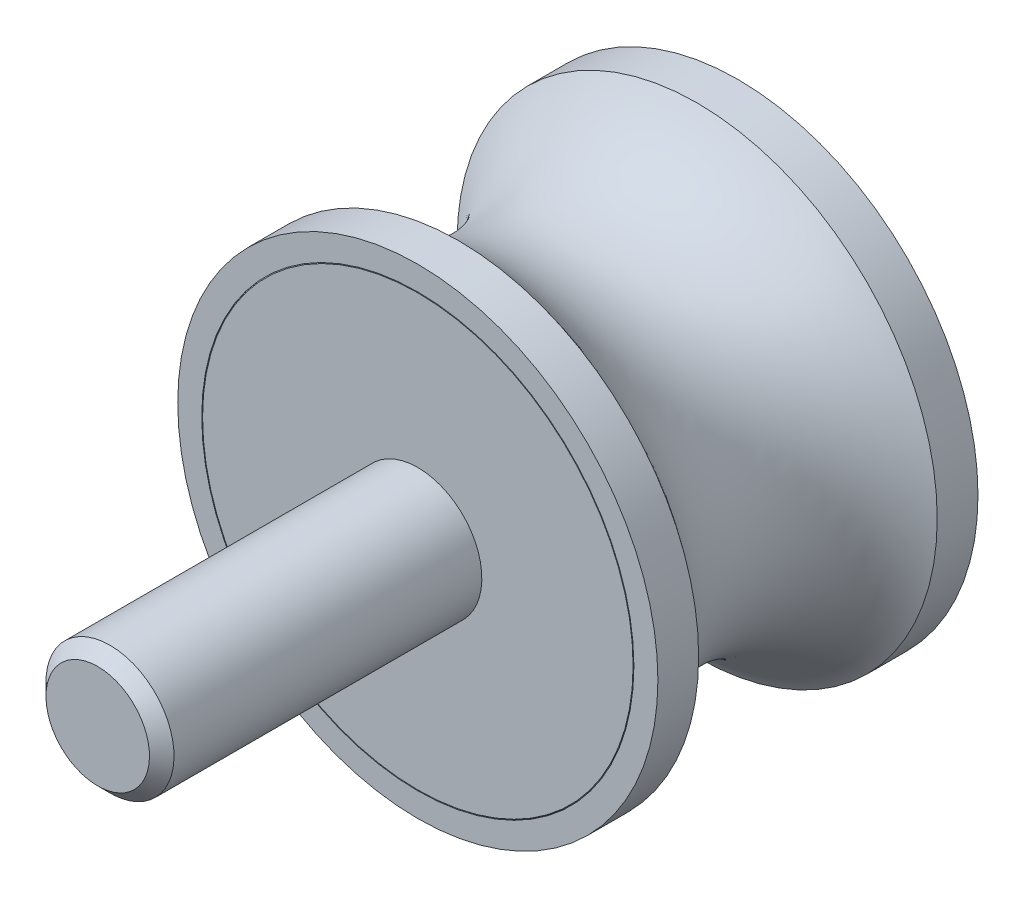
ISO-10303-21;
HEADER;
FILE_DESCRIPTION(('STEP AP214'),'2;1');
FILE_NAME('part.step','',(''),(''),'','','');
FILE_SCHEMA(('AUTOMOTIVE_DESIGN { 1 0 10303 214 1 1 1 1 }'));
ENDSEC;
DATA;
#1=APPLICATION_CONTEXT('core data for automotive mechanical design processes');
#2=APPLICATION_PROTOCOL_DEFINITION('international standard','automotive_design',2000,#1);
#3=PRODUCT_CONTEXT('',#1,'mechanical');
#4=PRODUCT('Part','Part','',(#3));
#5=PRODUCT_RELATED_PRODUCT_CATEGORY('part','',(#4));
#6=PRODUCT_DEFINITION_FORMATION('','',#4);
#7=PRODUCT_DEFINITION_CONTEXT('part definition',#1,'design');
#8=PRODUCT_DEFINITION('design','',#6,#7);
#9=PRODUCT_DEFINITION_SHAPE('','',#8);
#10=(LENGTH_UNIT() NAMED_UNIT(*) SI_UNIT(.MILLI.,.METRE.));
#11=(NAMED_UNIT(*) PLANE_ANGLE_UNIT() SI_UNIT($,.RADIAN.));
#12=(NAMED_UNIT(*) SI_UNIT($,.STERADIAN.) SOLID_ANGLE_UNIT());
#13=UNCERTAINTY_MEASURE_WITH_UNIT(LENGTH_MEASURE(1.E-05),#10,'distance_accuracy_value','');
#14=(GEOMETRIC_REPRESENTATION_CONTEXT(3) GLOBAL_UNCERTAINTY_ASSIGNED_CONTEXT((#13)) GLOBAL_UNIT_ASSIGNED_CONTEXT((#10,
#11,#12)) REPRESENTATION_CONTEXT('',''));
#15=CARTESIAN_POINT('',(0.,0.,0.));
#16=DIRECTION('',(0.,0.,1.));
#17=DIRECTION('',(1.,0.,0.));
#18=AXIS2_PLACEMENT_3D('',#15,#16,#17);
#19=CARTESIAN_POINT('',(0.,0.,0.5));
#20=DIRECTION('',(0.,0.,-1.));
#21=DIRECTION('',(0.,1.,0.));
#22=AXIS2_PLACEMENT_3D('',#19,#20,#21);
#23=CYLINDRICAL_SURFACE('',#22,13.5);
#24=CARTESIAN_POINT('',(0.,0.,0.05));
#25=DIRECTION('',(0.,0.,-1.));
#26=DIRECTION('',(0.,1.,0.));
#27=AXIS2_PLACEMENT_3D('',#24,#25,#26);
#28=CIRCLE('',#27,13.5);
#29=CARTESIAN_POINT('',(0.,13.5,0.05));
#30=VERTEX_POINT('',#29);
#31=EDGE_CURVE('E53',#30,#30,#28,.T.);
#32=ORIENTED_EDGE('',*,*,#31,.F.);
#33=EDGE_LOOP('',(#32));
#34=FACE_BOUND('',#33,.T.);
#35=CARTESIAN_POINT('',(0.,0.,0.));
#36=DIRECTION('',(0.,0.,-1.));
#37=DIRECTION('',(0.,1.,0.));
#38=AXIS2_PLACEMENT_3D('',#35,#36,#37);
#39=CIRCLE('',#38,13.5);
#40=CARTESIAN_POINT('',(0.,13.5,0.));
#41=VERTEX_POINT('',#40);
#42=EDGE_CURVE('E44',#41,#41,#39,.T.);
#43=ORIENTED_EDGE('',*,*,#42,.T.);
#44=EDGE_LOOP('',(#43));
#45=FACE_BOUND('',#44,.T.);
#46=ADVANCED_FACE('F12',(#34,#45),#23,.F.);
#47=CARTESIAN_POINT('',(0.,0.,0.5));
#48=DIRECTION('',(0.,0.,-1.));
#49=DIRECTION('',(0.,1.,0.));
#50=AXIS2_PLACEMENT_3D('',#47,#48,#49);
#51=CYLINDRICAL_SURFACE('',#50,13.5);
#52=CARTESIAN_POINT('',(0.,0.,20.));
#53=DIRECTION('',(0.,0.,-1.));
#54=DIRECTION('',(0.,1.,0.));
#55=AXIS2_PLACEMENT_3D('',#52,#53,#54);
#56=CIRCLE('',#55,13.5);
#57=CARTESIAN_POINT('',(0.,13.5,20.));
#58=VERTEX_POINT('',#57);
#59=EDGE_CURVE('E27',#58,#58,#56,.T.);
#60=ORIENTED_EDGE('',*,*,#59,.F.);
#61=EDGE_LOOP('',(#60));
#62=FACE_BOUND('',#61,.T.);
#63=CARTESIAN_POINT('',(0.,0.,19.95));
#64=DIRECTION('',(0.,0.,-1.));
#65=DIRECTION('',(0.,1.,0.));
#66=AXIS2_PLACEMENT_3D('',#63,#64,#65);
#67=CIRCLE('',#66,13.5);
#68=CARTESIAN_POINT('',(0.,13.5,19.95));
#69=VERTEX_POINT('',#68);
#70=EDGE_CURVE('E50',#69,#69,#67,.T.);
#71=ORIENTED_EDGE('',*,*,#70,.T.);
#72=EDGE_LOOP('',(#71));
#73=FACE_BOUND('',#72,.T.);
#74=ADVANCED_FACE('F89',(#62,#73),#51,.F.);
#75=CARTESIAN_POINT('',(13.5,0.,20.));
#76=DIRECTION('',(0.,0.,-1.));
#77=DIRECTION('',(0.,1.,0.));
#78=AXIS2_PLACEMENT_3D('',#75,#76,#77);
#79=PLANE('',#78);
#80=CARTESIAN_POINT('',(0.,0.,20.));
#81=DIRECTION('',(0.,0.,-1.));
#82=DIRECTION('',(0.,1.,0.));
#83=AXIS2_PLACEMENT_3D('',#80,#81,#82);
#84=CIRCLE('',#83,15.);
#85=CARTESIAN_POINT('',(0.,15.,20.));
#86=VERTEX_POINT('',#85);
#87=EDGE_CURVE('E32',#86,#86,#84,.T.);
#88=ORIENTED_EDGE('',*,*,#87,.F.);
#89=EDGE_LOOP('',(#88));
#90=FACE_BOUND('',#89,.T.);
#91=ORIENTED_EDGE('',*,*,#59,.T.);
#92=EDGE_LOOP('',(#91));
#93=FACE_BOUND('',#92,.T.);
#94=ADVANCED_FACE('F115',(#90,#93),#79,.F.);
#95=CARTESIAN_POINT('',(0.,0.,0.5));
#96=DIRECTION('',(0.,0.,-1.));
#97=DIRECTION('',(0.,1.,0.));
#98=AXIS2_PLACEMENT_3D('',#95,#96,#97);
#99=CYLINDRICAL_SURFACE('',#98,15.);
#100=CARTESIAN_POINT('',(0.,0.,17.4535599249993));
#101=DIRECTION('',(0.,0.,-1.));
#102=DIRECTION('',(0.,1.,0.));
#103=AXIS2_PLACEMENT_3D('',#100,#101,#102);
#104=CIRCLE('',#103,15.);
#105=CARTESIAN_POINT('',(0.,15.,17.4535599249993));
#106=VERTEX_POINT('',#105);
#107=EDGE_CURVE('E35',#106,#106,#104,.T.);
#108=ORIENTED_EDGE('',*,*,#107,.F.);
#109=EDGE_LOOP('',(#108));
#110=FACE_BOUND('',#109,.T.);
#111=ORIENTED_EDGE('',*,*,#87,.T.);
#112=EDGE_LOOP('',(#111));
#113=FACE_BOUND('',#112,.T.);
#114=ADVANCED_FACE('F109',(#110,#113),#99,.T.);
#115=CARTESIAN_POINT('',(0.,0.,10.));
#116=DIRECTION('',(0.,0.,-1.));
#117=DIRECTION('',(0.,1.,0.));
#118=AXIS2_PLACEMENT_3D('',#115,#116,#117);
#119=TOROIDAL_SURFACE('',#118,19.9444444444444,8.94444444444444);
#120=CARTESIAN_POINT('',(0.,0.,2.54644007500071));
#121=DIRECTION('',(0.,0.,-1.));
#122=DIRECTION('',(0.,1.,0.));
#123=AXIS2_PLACEMENT_3D('',#120,#121,#122);
#124=CIRCLE('',#123,15.);
#125=CARTESIAN_POINT('',(0.,15.,2.54644007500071));
#126=VERTEX_POINT('',#125);
#127=EDGE_CURVE('E38',#126,#126,#124,.T.);
#128=ORIENTED_EDGE('',*,*,#127,.F.);
#129=EDGE_LOOP('',(#128));
#130=FACE_BOUND('',#129,.T.);
#131=ORIENTED_EDGE('',*,*,#107,.T.);
#132=EDGE_LOOP('',(#131));
#133=FACE_BOUND('',#132,.T.);
#134=ADVANCED_FACE('F103',(#130,#133),#119,.F.);
#135=CARTESIAN_POINT('',(0.,0.,0.5));
#136=DIRECTION('',(0.,0.,-1.));
#137=DIRECTION('',(0.,1.,0.));
#138=AXIS2_PLACEMENT_3D('',#135,#136,#137);
#139=CYLINDRICAL_SURFACE('',#138,15.);
#140=CARTESIAN_POINT('',(0.,0.,0.));
#141=DIRECTION('',(0.,0.,-1.));
#142=DIRECTION('',(0.,1.,0.));
#143=AXIS2_PLACEMENT_3D('',#140,#141,#142);
#144=CIRCLE('',#143,15.);
#145=CARTESIAN_POINT('',(0.,15.,0.));
#146=VERTEX_POINT('',#145);
#147=EDGE_CURVE('E41',#146,#146,#144,.T.);
#148=ORIENTED_EDGE('',*,*,#147,.F.);
#149=EDGE_LOOP('',(#148));
#150=FACE_BOUND('',#149,.T.);
#151=ORIENTED_EDGE('',*,*,#127,.T.);
#152=EDGE_LOOP('',(#151));
#153=FACE_BOUND('',#152,.T.);
#154=ADVANCED_FACE('F97',(#150,#153),#139,.T.);
#155=CARTESIAN_POINT('',(15.,0.,0.));
#156=DIRECTION('',(0.,0.,1.));
#157=DIRECTION('',(0.,-1.,0.));
#158=AXIS2_PLACEMENT_3D('',#155,#156,#157);
#159=PLANE('',#158);
#160=ORIENTED_EDGE('',*,*,#42,.F.);
#161=EDGE_LOOP('',(#160));
#162=FACE_BOUND('',#161,.T.);
#163=ORIENTED_EDGE('',*,*,#147,.T.);
#164=EDGE_LOOP('',(#163));
#165=FACE_BOUND('',#164,.T.);
#166=ADVANCED_FACE('F93',(#162,#165),#159,.F.);
#167=CARTESIAN_POINT('',(0.,0.,20.));
#168=DIRECTION('',(0.,0.,-1.));
#169=DIRECTION('',(0.,1.,0.));
#170=AXIS2_PLACEMENT_3D('',#167,#168,#169);
#171=PLANE('',#170);
#172=CARTESIAN_POINT('',(0.,0.,20.));
#173=DIRECTION('',(0.,0.,-1.));
#174=DIRECTION('',(0.,1.,0.));
#175=AXIS2_PLACEMENT_3D('',#172,#173,#174);
#176=CIRCLE('',#175,13.45);
#177=CARTESIAN_POINT('',(0.,13.45,20.));
#178=VERTEX_POINT('',#177);
#179=EDGE_CURVE('E47',#178,#178,#176,.T.);
#180=ORIENTED_EDGE('',*,*,#179,.F.);
#181=EDGE_LOOP('',(#180));
#182=FACE_BOUND('',#181,.T.);
#183=CARTESIAN_POINT('',(0.,0.,20.));
#184=DIRECTION('',(0.,0.,-1.));
#185=DIRECTION('',(0.,1.,0.));
#186=AXIS2_PLACEMENT_3D('',#183,#184,#185);
#187=CIRCLE('',#186,4.);
#188=CARTESIAN_POINT('',(0.,4.,20.));
#189=VERTEX_POINT('',#188);
#190=EDGE_CURVE('E8',#189,#189,#187,.T.);
#191=ORIENTED_EDGE('',*,*,#190,.T.);
#192=EDGE_LOOP('',(#191));
#193=FACE_BOUND('',#192,.T.);
#194=ADVANCED_FACE('F96',(#182,#193),#171,.F.);
#195=CARTESIAN_POINT('',(0.,0.,20.));
#196=DIRECTION('',(0.,0.,-1.));
#197=DIRECTION('',(0.,1.,0.));
#198=AXIS2_PLACEMENT_3D('',#195,#196,#197);
#199=CONICAL_SURFACE('',#198,13.45,0.785398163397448);
#200=ORIENTED_EDGE('',*,*,#70,.F.);
#201=EDGE_LOOP('',(#200));
#202=FACE_BOUND('',#201,.T.);
#203=ORIENTED_EDGE('',*,*,#179,.T.);
#204=EDGE_LOOP('',(#203));
#205=FACE_BOUND('',#204,.T.);
#206=ADVANCED_FACE('F129',(#202,#205),#199,.T.);
#207=CARTESIAN_POINT('',(0.,0.,40.));
#208=DIRECTION('',(0.,0.,-1.));
#209=DIRECTION('',(0.,1.,0.));
#210=AXIS2_PLACEMENT_3D('',#207,#208,#209);
#211=PLANE('',#210);
#212=CARTESIAN_POINT('',(0.,0.,40.));
#213=DIRECTION('',(0.,0.,-1.));
#214=DIRECTION('',(0.,1.,0.));
#215=AXIS2_PLACEMENT_3D('',#212,#213,#214);
#216=CIRCLE('',#215,3.233);
#217=CARTESIAN_POINT('',(0.,3.233,40.));
#218=VERTEX_POINT('',#217);
#219=EDGE_CURVE('E19',#218,#218,#216,.T.);
#220=ORIENTED_EDGE('',*,*,#219,.F.);
#221=EDGE_LOOP('',(#220));
#222=FACE_BOUND('',#221,.T.);
#223=ADVANCED_FACE('F14',(#222),#211,.F.);
#224=CARTESIAN_POINT('',(0.,0.,40.));
#225=DIRECTION('',(0.,0.,-1.));
#226=DIRECTION('',(0.,1.,0.));
#227=AXIS2_PLACEMENT_3D('',#224,#225,#226);
#228=CONICAL_SURFACE('',#227,3.233,0.785398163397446);
#229=CARTESIAN_POINT('',(0.,0.,39.233));
#230=DIRECTION('',(0.,0.,-1.));
#231=DIRECTION('',(0.,1.,0.));
#232=AXIS2_PLACEMENT_3D('',#229,#230,#231);
#233=CIRCLE('',#232,4.);
#234=CARTESIAN_POINT('',(0.,4.,39.233));
#235=VERTEX_POINT('',#234);
#236=EDGE_CURVE('E23',#235,#235,#233,.T.);
#237=ORIENTED_EDGE('',*,*,#236,.F.);
#238=EDGE_LOOP('',(#237));
#239=FACE_BOUND('',#238,.T.);
#240=ORIENTED_EDGE('',*,*,#219,.T.);
#241=EDGE_LOOP('',(#240));
#242=FACE_BOUND('',#241,.T.);
#243=ADVANCED_FACE('F142',(#239,#242),#228,.T.);
#244=CARTESIAN_POINT('',(0.,0.,0.5));
#245=DIRECTION('',(0.,0.,-1.));
#246=DIRECTION('',(0.,1.,0.));
#247=AXIS2_PLACEMENT_3D('',#244,#245,#246);
#248=CYLINDRICAL_SURFACE('',#247,4.);
#249=ORIENTED_EDGE('',*,*,#190,.F.);
#250=EDGE_LOOP('',(#249));
#251=FACE_BOUND('',#250,.T.);
#252=ORIENTED_EDGE('',*,*,#236,.T.);
#253=EDGE_LOOP('',(#252));
#254=FACE_BOUND('',#253,.T.);
#255=ADVANCED_FACE('F83',(#251,#254),#248,.T.);
#256=CARTESIAN_POINT('',(0.,0.,0.05));
#257=DIRECTION('',(0.,0.,1.));
#258=DIRECTION('',(0.,-1.,0.));
#259=AXIS2_PLACEMENT_3D('',#256,#257,#258);
#260=CONICAL_SURFACE('',#259,13.5,0.785398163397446);
#261=CARTESIAN_POINT('',(0.,0.,0.));
#262=DIRECTION('',(0.,0.,-1.));
#263=DIRECTION('',(0.,1.,0.));
#264=AXIS2_PLACEMENT_3D('',#261,#262,#263);
#265=CIRCLE('',#264,13.45);
#266=CARTESIAN_POINT('',(0.,13.45,0.));
#267=VERTEX_POINT('',#266);
#268=EDGE_CURVE('E56',#267,#267,#265,.T.);
#269=ORIENTED_EDGE('',*,*,#268,.F.);
#270=EDGE_LOOP('',(#269));
#271=FACE_BOUND('',#270,.T.);
#272=ORIENTED_EDGE('',*,*,#31,.T.);
#273=EDGE_LOOP('',(#272));
#274=FACE_BOUND('',#273,.T.);
#275=ADVANCED_FACE('F77',(#271,#274),#260,.T.);
#276=CARTESIAN_POINT('',(13.45,0.,0.));
#277=DIRECTION('',(0.,0.,1.));
#278=DIRECTION('',(0.,-1.,0.));
#279=AXIS2_PLACEMENT_3D('',#276,#277,#278);
#280=PLANE('',#279);
#281=CARTESIAN_POINT('',(0.,0.,0.));
#282=DIRECTION('',(0.,0.,-1.));
#283=DIRECTION('',(0.,1.,0.));
#284=AXIS2_PLACEMENT_3D('',#281,#282,#283);
#285=CIRCLE('',#284,4.);
#286=CARTESIAN_POINT('',(0.,4.,0.));
#287=VERTEX_POINT('',#286);
#288=EDGE_CURVE('E60',#287,#287,#285,.T.);
#289=ORIENTED_EDGE('',*,*,#288,.F.);
#290=EDGE_LOOP('',(#289));
#291=FACE_BOUND('',#290,.T.);
#292=ORIENTED_EDGE('',*,*,#268,.T.);
#293=EDGE_LOOP('',(#292));
#294=FACE_BOUND('',#293,.T.);
#295=ADVANCED_FACE('F71',(#291,#294),#280,.F.);
#296=CARTESIAN_POINT('',(0.,0.,8.));
#297=DIRECTION('',(0.,0.,-1.));
#298=DIRECTION('',(0.,1.,0.));
#299=AXIS2_PLACEMENT_3D('',#296,#297,#298);
#300=CYLINDRICAL_SURFACE('',#299,4.);
#301=CARTESIAN_POINT('',(0.,0.,8.));
#302=DIRECTION('',(0.,0.,-1.));
#303=DIRECTION('',(0.,1.,0.));
#304=AXIS2_PLACEMENT_3D('',#301,#302,#303);
#305=CIRCLE('',#304,4.);
#306=CARTESIAN_POINT('',(0.,4.,8.));
#307=VERTEX_POINT('',#306);
#308=EDGE_CURVE('E59',#307,#307,#305,.T.);
#309=ORIENTED_EDGE('',*,*,#308,.F.);
#310=EDGE_LOOP('',(#309));
#311=FACE_BOUND('',#310,.T.);
#312=ORIENTED_EDGE('',*,*,#288,.T.);
#313=EDGE_LOOP('',(#312));
#314=FACE_BOUND('',#313,.T.);
#315=ADVANCED_FACE('F68',(#311,#314),#300,.F.);
#316=CARTESIAN_POINT('',(0.,0.,8.));
#317=DIRECTION('',(0.,0.,-1.));
#318=DIRECTION('',(0.,1.,0.));
#319=AXIS2_PLACEMENT_3D('',#316,#317,#318);
#320=PLANE('',#319);
#321=ORIENTED_EDGE('',*,*,#308,.T.);
#322=EDGE_LOOP('',(#321));
#323=FACE_BOUND('',#322,.T.);
#324=ADVANCED_FACE('F66',(#323),#320,.T.);
#325=CLOSED_SHELL('',(#46,#74,#94,#114,#134,#154,#166,#194,#206,#223,#243,#255,#275,#295,#315,#324));
#326=MANIFOLD_SOLID_BREP('B1',#325);
#327=ADVANCED_BREP_SHAPE_REPRESENTATION('',(#18,#326),#14);
#328=SHAPE_DEFINITION_REPRESENTATION(#9,#327);
ENDSEC;
END-ISO-10303-21;
